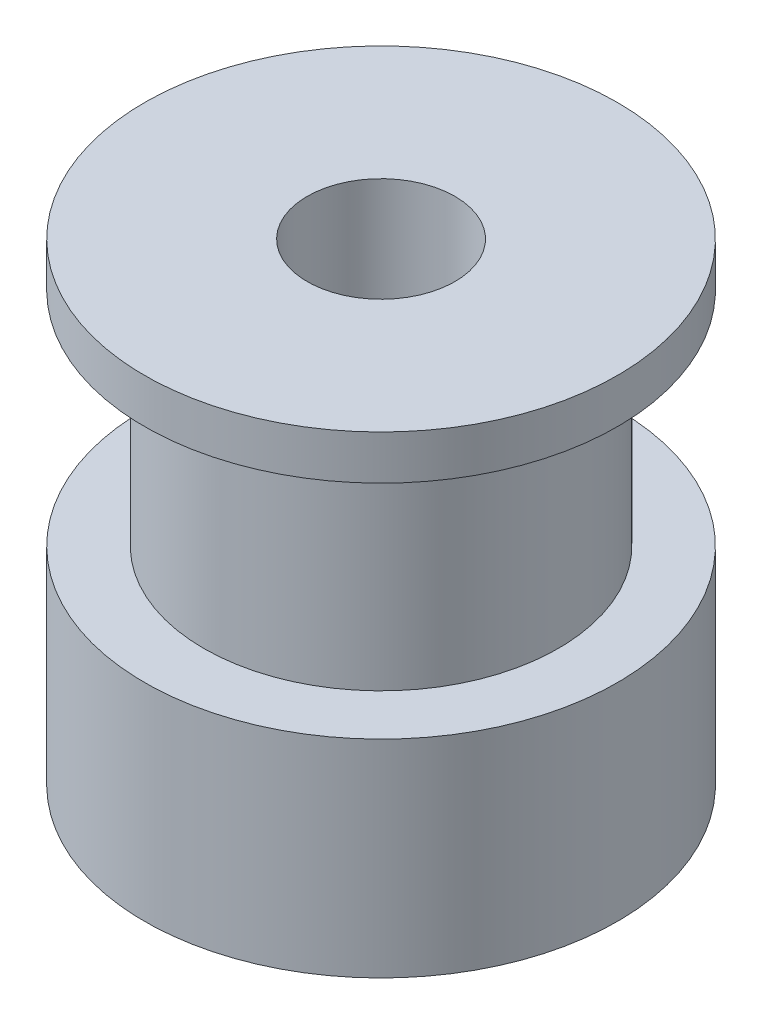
from build123d import *

# Parameters (mm, degrees)
SKETCH_1_W   = 3.5
SKETCH_1_H   = 7.5
SKETCH_1_W_2 = 5.5
SKETCH_1_H_2 = 7


with BuildPart() as part:
    # Sketch 1 → Revolve 1 (revolve)
    with BuildSketch(Plane.XY, mode=Mode.PRIVATE) as revolve_1_sk:
        Polygon((-6, 14.5), (-2.5, 14.5), (-2.5, 16), (-8, 16), (-8, 14.5), align=None)
        with Locations((-4.25, 10.75)):
            Rectangle(SKETCH_1_W, SKETCH_1_H)
        with Locations((-5.25, 3.5)):
            Rectangle(SKETCH_1_W_2, SKETCH_1_H_2)
    revolve(revolve_1_sk.sketch.rotate(Axis((0, 0, 0), (0, 1, 0)), 270), axis=Axis((0, 0, 0), (0, 1, 0)))


solid = part.part
